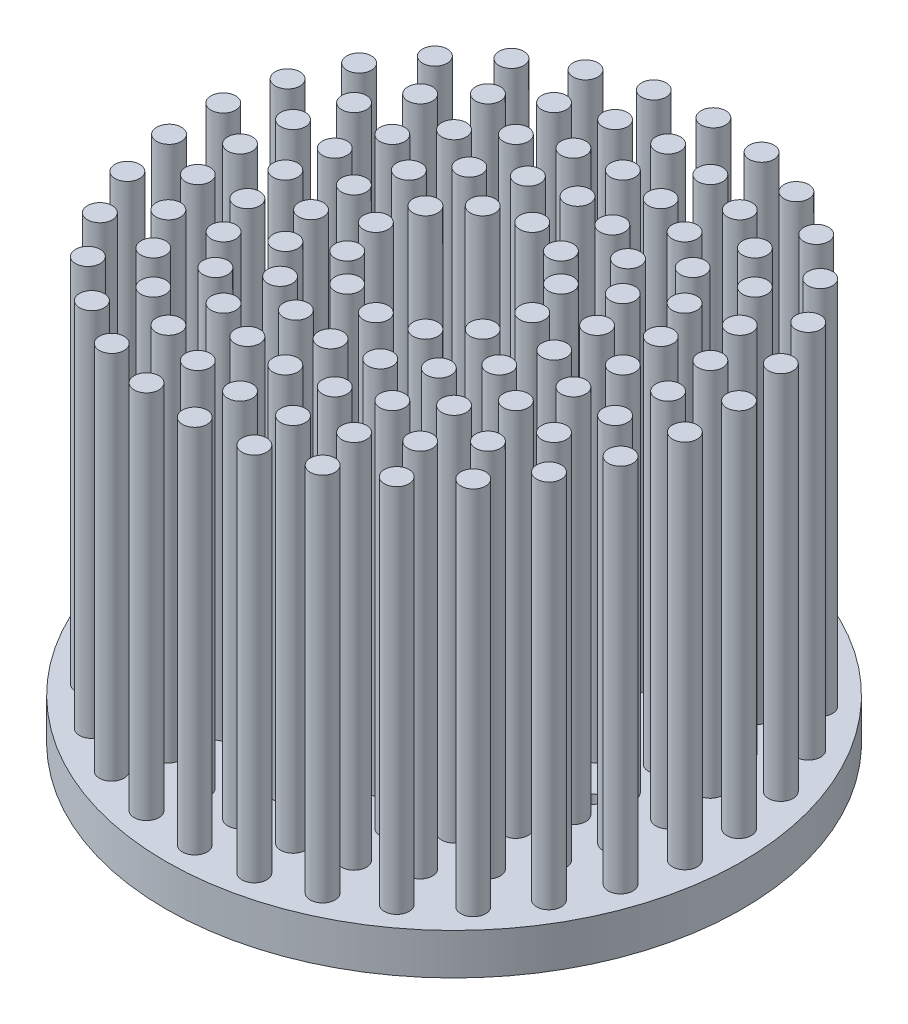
from build123d import *

# Parameters (mm, degrees)
SKETCH_1_R                = 35
EXTRUDE_1_DEPTH           = 3
SKETCH_2_R                = 1.5
EXTRUDE_2_DEPTH           = 27
SKETCH_6_R                = 1.5
EXTRUDE_4_DEPTH           = 27
PATTERN_CIRCULAR_3_COUNT  = 6
SKETCH_7_R                = 1.5
EXTRUDE_5_DEPTH           = 27
PATTERN_CIRCULAR_4_COUNT  = 12
SKETCH_8_R                = 1.5
EXTRUDE_6_DEPTH           = 27
PATTERN_CIRCULAR_5_COUNT  = 18
SKETCH_10_R               = 1.5
EXTRUDE_7_DEPTH           = 27
PATTERN_CIRCULAR_6_COUNT  = 24
SKETCH_11_R               = 1.5
EXTRUDE_8_DEPTH           = 27
PATTERN_CIRCULAR_7_COUNT  = 28
SKETCH_13_R               = 7
CUT_EXTRUDE_3_DEPTH       = 27
SKETCH_15_R               = 1.5
EXTRUDE_10_DEPTH          = 27
PATTERN_CIRCULAR_8_COUNT  = 5
SKETCH_23_R               = 1.5
EXTRUDE_16_DEPTH          = 27
PATTERN_CIRCULAR_9_COUNT  = 30
SKETCH_26_R               = 1.5
EXTRUDE_18_DEPTH          = 37
SKETCH_27_R               = 35
EXTRUDE_19_DEPTH          = 2
M2X0_4_TAPPED_HOLE1_D     = 1.6
M2X0_4_TAPPED_HOLE1_DEPTH = 6
M2X0_4_TAPPED_HOLE1_TIP   = 0.480688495
SKETCH5_R                 = 5.75
EXTRUDE2_DEPTH            = 64.639610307
SKETCH6_R                 = 42.190571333
EXTRUDE3_DEPTH            = 10
SKETCH7_R                 = 1.5
EXTRUDE4_DEPTH            = 20


with BuildPart() as part:
    # Sketch 1 → Extrude 1 (new body)
    with BuildSketch(Plane(origin=(0, 0, 0), x_dir=(1, 0, 0), z_dir=(0, 1, 0))):
        with Locations(Location((0, 0, 0), (0, 0, 270))):
            Circle(SKETCH_1_R)
    extrude(amount=EXTRUDE_1_DEPTH)

    # Sketch 2 → Extrude 2 (add)
    with BuildSketch(Plane(origin=(0, 3, 0), x_dir=(1, 0, 0), z_dir=(0, 1, 0))):
        with Locations(Location((0, 0, 0), (0, 0, 270))):
            Circle(SKETCH_2_R)
    extrude(amount=EXTRUDE_2_DEPTH)

    # Sketch 6 → Extrude 4 (add)
    with BuildSketch(Plane(origin=(0, 3, 0), x_dir=(1, 0, 0), z_dir=(0, 1, 0))):
        with Locations(Location((0, 5.5, 0), (0, 0, 270))):
            Circle(SKETCH_6_R)
    extrude_4 = extrude(amount=EXTRUDE_4_DEPTH)

    # Pattern Circular 3: Extrude 4 ×6 about axis
    pattern_circular_3_axis = Axis((0, 0, 0), (0, 1, 0))
    for i in range(1, PATTERN_CIRCULAR_3_COUNT):
        add(extrude_4.rotate(pattern_circular_3_axis, i * 360 / PATTERN_CIRCULAR_3_COUNT))

    # Sketch 7 → Extrude 5 (add)
    with BuildSketch(Plane(origin=(0, 3, 0), x_dir=(1, 0, 0), z_dir=(0, 1, 0))):
        with Locations(Location((0, 9.5, 0), (0, 0, 270))):
            Circle(SKETCH_7_R)
    extrude_5 = extrude(amount=EXTRUDE_5_DEPTH)

    # Pattern Circular 4: Extrude 5 ×12 about axis
    pattern_circular_4_axis = Axis((0, 0, 0), (0, 1, 0))
    for i in range(1, PATTERN_CIRCULAR_4_COUNT):
        add(extrude_5.rotate(pattern_circular_4_axis, i * 360 / PATTERN_CIRCULAR_4_COUNT))

    # Sketch 8 → Extrude 6 (add)
    with BuildSketch(Plane(origin=(0, 3, 0), x_dir=(1, 0, 0), z_dir=(0, 1, 0))):
        with Locations(Location((0, 15, 0), (0, 0, 270))):
            Circle(SKETCH_8_R)
    extrude_6 = extrude(amount=EXTRUDE_6_DEPTH)

    # Pattern Circular 5: Extrude 6 ×18 about axis
    pattern_circular_5_axis = Axis((0, 0, 0), (0, 1, 0))
    for i in range(1, PATTERN_CIRCULAR_5_COUNT):
        add(extrude_6.rotate(pattern_circular_5_axis, i * 360 / PATTERN_CIRCULAR_5_COUNT))

    # Sketch 10 → Extrude 7 (add)
    with BuildSketch(Plane(origin=(0, 3, 0), x_dir=(1, 0, 0), z_dir=(0, 1, 0))):
        with Locations(Location((0, 20.5, 0), (0, 0, 270))):
            Circle(SKETCH_10_R)
    extrude_7 = extrude(amount=EXTRUDE_7_DEPTH)

    # Pattern Circular 6: Extrude 7 ×24 about axis
    pattern_circular_6_axis = Axis((0, 0, 0), (0, 1, 0))
    for i in range(1, PATTERN_CIRCULAR_6_COUNT):
        add(extrude_7.rotate(pattern_circular_6_axis, i * 360 / PATTERN_CIRCULAR_6_COUNT))

    # Sketch 11 → Extrude 8 (add)
    with BuildSketch(Plane(origin=(0, 3, 0), x_dir=(1, 0, 0), z_dir=(0, 1, 0))):
        with Locations(Location((0, 26, 0), (0, 0, 270))):
            Circle(SKETCH_11_R)
    extrude_8 = extrude(amount=EXTRUDE_8_DEPTH)

    # Pattern Circular 7: Extrude 8 ×28 about axis
    pattern_circular_7_axis = Axis((0, 0, 0), (0, 1, 0))
    for i in range(1, PATTERN_CIRCULAR_7_COUNT):
        add(extrude_8.rotate(pattern_circular_7_axis, i * 360 / PATTERN_CIRCULAR_7_COUNT))

    # Sketch 13 → Cut-Extrude 3 (cut)
    with BuildSketch(Plane(origin=(0, 3, 0), x_dir=(1, 0, 0), z_dir=(0, 1, 0))):
        Circle(SKETCH_13_R)
    extrude(amount=CUT_EXTRUDE_3_DEPTH, mode=Mode.SUBTRACT)

    # Sketch 15 → Extrude 10 (add)
    with BuildSketch(Plane(origin=(0, 3, 0), x_dir=(1, 0, 0), z_dir=(0, 1, 0))):
        with Locations(Location((0, 4, 0), (0, 0, 270))):
            Circle(SKETCH_15_R)
    extrude_10 = extrude(amount=EXTRUDE_10_DEPTH)

    # Pattern Circular 8: Extrude 10 ×5 about axis
    pattern_circular_8_axis = Axis((0, 0, 0), (0, 1, 0))
    for i in range(1, PATTERN_CIRCULAR_8_COUNT):
        add(extrude_10.rotate(pattern_circular_8_axis, i * 360 / PATTERN_CIRCULAR_8_COUNT))

    # Sketch 23 → Extrude 16 (add)
    with BuildSketch(Plane(origin=(0, 3, 0), x_dir=(1, 0, 0), z_dir=(0, 1, 0))):
        with Locations(Location((0, 31.5, 0), (0, 0, 270))):
            Circle(SKETCH_23_R)
    extrude_16 = extrude(amount=EXTRUDE_16_DEPTH)

    # Pattern Circular 9: Extrude 16 ×30 about axis
    pattern_circular_9_axis = Axis((0, 0, 0), (0, 1, 0))
    for i in range(1, PATTERN_CIRCULAR_9_COUNT):
        add(extrude_16.rotate(pattern_circular_9_axis, i * 360 / PATTERN_CIRCULAR_9_COUNT))

    # Sketch 26 → Extrude 18 (add)
    with BuildSketch(Plane(origin=(0, 3, 0), x_dir=(1, 0, 0), z_dir=(0, 1, 0))):
        with Locations(Location((-17.753520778, -10.25, 0), (0, 0, 30))):
            Circle(SKETCH_26_R)
        with Locations(Location((-14.772116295, -2.604722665, 0), (0, 0, 10))):
            Circle(SKETCH_26_R)
        with Locations(Location((-19.801479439, -5.305790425, 0), (0, 0, 15))):
            Circle(SKETCH_26_R)
        with Locations(Location((-19.801479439, 5.305790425, 0), (0, 0, 345))):
            Circle(SKETCH_26_R)
        with Locations(Location((-17.753520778, 10.25, 0), (0, 0, 330))):
            Circle(SKETCH_26_R)
        with Locations(Location((-12.990381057, 7.5, 0), (0, 0, 330))):
            Circle(SKETCH_26_R)
        with Locations(Location((-9.641814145, 11.490666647, 0), (0, 0, 310))):
            Circle(SKETCH_26_R)
        with Locations(Location((-14.495689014, 14.495689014, 0), (0, 0, 315))):
            Circle(SKETCH_26_R)
        with Locations(Location((-10.25, 17.753520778, 0), (0, 0, 300))):
            Circle(SKETCH_26_R)
        with Locations(Location((-4.75, 8.227241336, 0), (0, 0, 300))):
            Circle(SKETCH_26_R)
        with Locations(Location((9.641814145, 11.490666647, 0), (0, 0, 230))):
            Circle(SKETCH_26_R)
        with Locations(Location((12.990381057, 7.5, 0), (0, 0, 210))):
            Circle(SKETCH_26_R)
        with Locations(Location((14.772116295, 2.604722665, 0), (0, 0, 190))):
            Circle(SKETCH_26_R)
        with Locations(Location((8.227241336, 4.75, 0), (0, 0, 210))):
            Circle(SKETCH_26_R)
        with Locations(Location((3.804226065, 1.236067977, 0), (0, 0, 198))):
            Circle(SKETCH_26_R)
        with Locations(Location((19.801479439, -5.305790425, 0), (0, 0, 165))):
            Circle(SKETCH_26_R)
        with Locations(Location((0, 26, 0), (0, 0, 270))):
            Circle(SKETCH_26_R)
        with Locations(Location((-6.549218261, 30.811649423, 0), (0, 0, 282))):
            Circle(SKETCH_26_R)
        with Locations(Location((-5.305790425, -19.801479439, 0), (0, 0, 75))):
            Circle(SKETCH_26_R)
        with Locations(Location((12.990381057, -7.5, 0), (0, 0, 150))):
            Circle(SKETCH_26_R)
        with Locations(Location((9.641814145, -11.490666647, 0), (0, 0, 130))):
            Circle(SKETCH_26_R)
        with Locations(Location((5.13030215, -14.095389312, 0), (0, 0, 110))):
            Circle(SKETCH_26_R)
        with Locations(Location((0, -9.5, 0), (0, 0, 90))):
            Circle(SKETCH_26_R)
        with Locations(Location((8.227241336, -4.75, 0), (0, 0, 150))):
            Circle(SKETCH_26_R)
        with Locations(Location((2.351141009, -3.236067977, 0), (0, 0, 126))):
            Circle(SKETCH_26_R)
        with Locations(Location((0, 4, 0), (0, 0, 270))):
            Circle(SKETCH_26_R)
        with Locations(Location((-8.227241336, 4.75, 0), (0, 0, 330))):
            Circle(SKETCH_26_R)
        with Locations((-9.5, 0)):
            Circle(SKETCH_26_R)
        with Locations(Location((-8.227241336, -4.75, 0), (0, 0, 30))):
            Circle(SKETCH_26_R)
        with Locations(Location((-4.75, -8.227241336, 0), (0, 0, 60))):
            Circle(SKETCH_26_R)
        with Locations(Location((-5.13030215, -14.095389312, 0), (0, 0, 70))):
            Circle(SKETCH_26_R)
        with Locations(Location((-10.25, -17.753520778, 0), (0, 0, 60))):
            Circle(SKETCH_26_R)
        with Locations(Location((-23.425190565, -11.280977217, 0), (0, 0, 25.714285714))):
            Circle(SKETCH_26_R)
        with Locations(Location((-29.958280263, -9.734035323, 0), (0, 0, 18))):
            Circle(SKETCH_26_R)
        with Locations((-26, 0)):
            Circle(SKETCH_26_R)
        with Locations(Location((-23.425190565, 11.280977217, 0), (0, 0, 334.285714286))):
            Circle(SKETCH_26_R)
        with Locations(Location((-18.515235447, 25.484035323, 0), (0, 0, 306))):
            Circle(SKETCH_26_R)
        with Locations(Location((-12.812204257, 28.776681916, 0), (0, 0, 294))):
            Circle(SKETCH_26_R)
        with Locations(Location((5.13030215, 14.095389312, 0), (0, 0, 250))):
            Circle(SKETCH_26_R)
        with Locations(Location((5.305790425, 19.801479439, 0), (0, 0, 255))):
            Circle(SKETCH_26_R)
        with Locations(Location((10.25, 17.753520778, 0), (0, 0, 240))):
            Circle(SKETCH_26_R)
        with Locations(Location((14.495689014, 14.495689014, 0), (0, 0, 225))):
            Circle(SKETCH_26_R)
        with Locations(Location((19.801479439, 5.305790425, 0), (0, 0, 195))):
            Circle(SKETCH_26_R)
        with Locations(Location((29.958280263, 9.734035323, 0), (0, 0, 198))):
            Circle(SKETCH_26_R)
        with Locations(Location((23.425190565, 11.280977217, 0), (0, 0, 205.714285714))):
            Circle(SKETCH_26_R)
        with Locations(Location((20.327618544, 16.210734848, 0), (0, 0, 218.571428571))):
            Circle(SKETCH_26_R)
        with Locations(Location((16.210734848, 20.327618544, 0), (0, 0, 231.428571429))):
            Circle(SKETCH_26_R)
        with Locations(Location((5.785544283, 25.348125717, 0), (0, 0, 257.142857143))):
            Circle(SKETCH_26_R)
        with Locations(Location((0, 9.5, 0), (0, 0, 270))):
            Circle(SKETCH_26_R)
        with Locations(Location((4.75, 8.227241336, 0), (0, 0, 240))):
            Circle(SKETCH_26_R)
        with Locations(Location((9.5, 0, 0), (0, 0, 180))):
            Circle(SKETCH_26_R)
        with Locations(Location((14.772116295, -2.604722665, 0), (0, 0, 170))):
            Circle(SKETCH_26_R)
        with Locations(Location((20.5, 0, 0), (0, 0, 180))):
            Circle(SKETCH_26_R)
        with Locations(Location((25.348125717, -5.785544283, 0), (0, 0, 167.142857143))):
            Circle(SKETCH_26_R)
        with Locations(Location((23.425190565, -11.280977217, 0), (0, 0, 154.285714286))):
            Circle(SKETCH_26_R)
        with Locations(Location((12.812204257, -28.776681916, 0), (0, 0, 114))):
            Circle(SKETCH_26_R)
        with Locations(Location((6.549218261, -30.811649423, 0), (0, 0, 102))):
            Circle(SKETCH_26_R)
        with Locations(Location((5.785544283, -25.348125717, 0), (0, 0, 102.857142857))):
            Circle(SKETCH_26_R)
        with Locations(Location((0, -31.5, 0), (0, 0, 90))):
            Circle(SKETCH_26_R)
        with Locations(Location((-6.549218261, -30.811649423, 0), (0, 0, 78))):
            Circle(SKETCH_26_R)
        with Locations(Location((-12.812204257, -28.776681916, 0), (0, 0, 66))):
            Circle(SKETCH_26_R)
        with Locations(Location((-18.515235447, -25.484035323, 0), (0, 0, 54))):
            Circle(SKETCH_26_R)
        with Locations(Location((-16.210734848, -20.327618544, 0), (0, 0, 51.428571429))):
            Circle(SKETCH_26_R)
        with Locations(Location((-23.409062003, -21.0776141, 0), (0, 0, 42))):
            Circle(SKETCH_26_R)
        with Locations(Location((0, -20.5, 0), (0, 0, 90))):
            Circle(SKETCH_26_R)
        with Locations(Location((5.305790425, -19.801479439, 0), (0, 0, 105))):
            Circle(SKETCH_26_R)
        with Locations(Location((10.25, -17.753520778, 0), (0, 0, 120))):
            Circle(SKETCH_26_R)
        with Locations(Location((14.495689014, -14.495689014, 0), (0, 0, 135))):
            Circle(SKETCH_26_R)
        with Locations(Location((17.753520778, -10.25, 0), (0, 0, 150))):
            Circle(SKETCH_26_R)
        with Locations(Location((0, -15, 0), (0, 0, 90))):
            Circle(SKETCH_26_R)
        with Locations(Location((4.75, -8.227241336, 0), (0, 0, 120))):
            Circle(SKETCH_26_R)
        with Locations(Location((-2.351141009, -3.236067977, 0), (0, 0, 54))):
            Circle(SKETCH_26_R)
        with Locations(Location((-3.804226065, 1.236067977, 0), (0, 0, 342))):
            Circle(SKETCH_26_R)
        with Locations(Location((-14.495689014, -14.495689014, 0), (0, 0, 45))):
            Circle(SKETCH_26_R)
        with Locations(Location((-9.641814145, -11.490666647, 0), (0, 0, 50))):
            Circle(SKETCH_26_R)
        with Locations(Location((-12.990381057, -7.5, 0), (0, 0, 30))):
            Circle(SKETCH_26_R)
        with Locations((-20.5, 0)):
            Circle(SKETCH_26_R)
        with Locations(Location((-14.772116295, 2.604722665, 0), (0, 0, 350))):
            Circle(SKETCH_26_R)
        with Locations(Location((-5.13030215, 14.095389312, 0), (0, 0, 290))):
            Circle(SKETCH_26_R)
        with Locations(Location((23.409062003, 21.0776141, 0), (0, 0, 222))):
            Circle(SKETCH_26_R)
        with Locations(Location((18.515235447, 25.484035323, 0), (0, 0, 234))):
            Circle(SKETCH_26_R)
        with Locations(Location((11.280977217, 23.425190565, 0), (0, 0, 244.285714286))):
            Circle(SKETCH_26_R)
        with Locations(Location((12.812204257, 28.776681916, 0), (0, 0, 246))):
            Circle(SKETCH_26_R)
        with Locations(Location((6.549218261, 30.811649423, 0), (0, 0, 258))):
            Circle(SKETCH_26_R)
        with Locations(Location((0, 31.5, 0), (0, 0, 270))):
            Circle(SKETCH_26_R)
        with Locations(Location((-31.327439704, -3.292646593, 0), (0, 0, 6))):
            Circle(SKETCH_26_R)
        with Locations(Location((-31.327439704, 3.292646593, 0), (0, 0, 354))):
            Circle(SKETCH_26_R)
        with Locations(Location((-29.958280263, 9.734035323, 0), (0, 0, 342))):
            Circle(SKETCH_26_R)
        with Locations(Location((-25.348125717, 5.785544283, 0), (0, 0, 347.142857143))):
            Circle(SKETCH_26_R)
        with Locations(Location((-27.279800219, 15.75, 0), (0, 0, 330))):
            Circle(SKETCH_26_R)
        with Locations(Location((-20.327618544, 16.210734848, 0), (0, 0, 321.428571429))):
            Circle(SKETCH_26_R)
        with Locations(Location((-23.409062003, 21.0776141, 0), (0, 0, 318))):
            Circle(SKETCH_26_R)
        with Locations(Location((-16.210734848, 20.327618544, 0), (0, 0, 308.571428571))):
            Circle(SKETCH_26_R)
        with Locations(Location((-11.280977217, 23.425190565, 0), (0, 0, 295.714285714))):
            Circle(SKETCH_26_R)
        with Locations(Location((-5.785544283, 25.348125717, 0), (0, 0, 282.857142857))):
            Circle(SKETCH_26_R)
        with Locations(Location((-5.305790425, 19.801479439, 0), (0, 0, 285))):
            Circle(SKETCH_26_R)
        with Locations(Location((0, 20.5, 0), (0, 0, 270))):
            Circle(SKETCH_26_R)
        with Locations(Location((0, 15, 0), (0, 0, 270))):
            Circle(SKETCH_26_R)
        with Locations(Location((17.753520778, 10.25, 0), (0, 0, 210))):
            Circle(SKETCH_26_R)
        with Locations(Location((25.348125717, 5.785544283, 0), (0, 0, 192.857142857))):
            Circle(SKETCH_26_R)
        with Locations(Location((27.279800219, 15.75, 0), (0, 0, 210))):
            Circle(SKETCH_26_R)
        with Locations(Location((26, 0, 0), (0, 0, 180))):
            Circle(SKETCH_26_R)
        with Locations(Location((31.327439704, -3.292646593, 0), (0, 0, 174))):
            Circle(SKETCH_26_R)
        with Locations(Location((31.327439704, 3.292646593, 0), (0, 0, 186))):
            Circle(SKETCH_26_R)
        with Locations(Location((29.958280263, -9.734035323, 0), (0, 0, 162))):
            Circle(SKETCH_26_R)
        with Locations(Location((27.279800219, -15.75, 0), (0, 0, 150))):
            Circle(SKETCH_26_R)
        with Locations(Location((20.327618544, -16.210734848, 0), (0, 0, 141.428571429))):
            Circle(SKETCH_26_R)
        with Locations(Location((23.409062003, -21.0776141, 0), (0, 0, 138))):
            Circle(SKETCH_26_R)
        with Locations(Location((16.210734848, -20.327618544, 0), (0, 0, 128.571428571))):
            Circle(SKETCH_26_R)
        with Locations(Location((18.515235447, -25.484035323, 0), (0, 0, 126))):
            Circle(SKETCH_26_R)
        with Locations(Location((11.280977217, -23.425190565, 0), (0, 0, 115.714285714))):
            Circle(SKETCH_26_R)
        with Locations(Location((0, -26, 0), (0, 0, 90))):
            Circle(SKETCH_26_R)
        with Locations(Location((-5.785544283, -25.348125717, 0), (0, 0, 77.142857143))):
            Circle(SKETCH_26_R)
        with Locations(Location((-11.280977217, -23.425190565, 0), (0, 0, 64.285714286))):
            Circle(SKETCH_26_R)
        with Locations(Location((-20.327618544, -16.210734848, 0), (0, 0, 38.571428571))):
            Circle(SKETCH_26_R)
        with Locations(Location((-27.279800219, -15.75, 0), (0, 0, 30))):
            Circle(SKETCH_26_R)
        with Locations(Location((-25.348125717, -5.785544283, 0), (0, 0, 12.857142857))):
            Circle(SKETCH_26_R)
    extrude(amount=EXTRUDE_18_DEPTH)

    # Sketch 27 → Extrude 19 (add)
    with BuildSketch(Plane(origin=(0, 3, 0), x_dir=(1, 0, 0), z_dir=(0, 1, 0))):
        with Locations(Location((0, 0, 0), (0, 0, 270))):
            Circle(SKETCH_27_R)
    extrude(amount=EXTRUDE_19_DEPTH)

    # M2x0.4 Tapped Hole1
    with Locations(Plane.XZ):
        with Locations((-11.870847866, 15.470390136), (19.333174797, 2.545260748), (-7.462326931, -18.015650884)):
            Hole(M2X0_4_TAPPED_HOLE1_D / 2, depth=M2X0_4_TAPPED_HOLE1_DEPTH)
            with Locations((0, 0, -(M2X0_4_TAPPED_HOLE1_DEPTH + M2X0_4_TAPPED_HOLE1_TIP / 2))):  # 118° drill point
                Cone(0, M2X0_4_TAPPED_HOLE1_D / 2, M2X0_4_TAPPED_HOLE1_TIP, mode=Mode.SUBTRACT)

    # Sketch5 → Extrude2 (cut, through all)
    with BuildSketch(Plane.XZ):
        with Locations(Location((0, 0, 0), (0, 0, 270))):
            Circle(SKETCH5_R)
    extrude(amount=-EXTRUDE2_DEPTH, mode=Mode.SUBTRACT)

    # Sketch6 → Extrude3 (cut)
    with BuildSketch(Plane(origin=(0, 40, 0), x_dir=(1, 0, 0), z_dir=(0, 1, 0))):
        Circle(SKETCH6_R)
    extrude(amount=-EXTRUDE3_DEPTH, mode=Mode.SUBTRACT)

    # Sketch7 → Extrude4 (add)
    with BuildSketch(Plane(origin=(0, 30, 0), x_dir=(1, 0, 0), z_dir=(0, 1, 0))):
        with Locations(Location((8.227241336, 4.75, 0), (0, 0, 270))):
            Circle(SKETCH7_R)
        with Locations(Location((4.75, 8.227241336, 0), (0, 0, 270))):
            Circle(SKETCH7_R)
        with Locations(Location((-4.75, 8.227241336, 0), (0, 0, 270))):
            Circle(SKETCH7_R)
        with Locations(Location((-8.227241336, 4.75, 0), (0, 0, 270))):
            Circle(SKETCH7_R)
        with Locations(Location((-9.5, 0, 0), (0, 0, 270))):
            Circle(SKETCH7_R)
        with Locations(Location((-8.227241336, -4.75, 0), (0, 0, 270))):
            Circle(SKETCH7_R)
        with Locations(Location((-4.75, -8.227241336, 0), (0, 0, 270))):
            Circle(SKETCH7_R)
        with Locations(Location((0, -9.5, 0), (0, 0, 270))):
            Circle(SKETCH7_R)
        with Locations(Location((4.75, -8.227241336, 0), (0, 0, 270))):
            Circle(SKETCH7_R)
        with Locations(Location((8.227241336, -4.75, 0), (0, 0, 270))):
            Circle(SKETCH7_R)
        with Locations(Location((9.5, 0, 0), (0, 0, 270))):
            Circle(SKETCH7_R)
        with Locations(Location((14.772116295, 2.604722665, 0), (0, 0, 270))):
            Circle(SKETCH7_R)
        with Locations(Location((14.772116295, -2.604722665, 0), (0, 0, 270))):
            Circle(SKETCH7_R)
        with Locations(Location((12.990381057, -7.5, 0), (0, 0, 270))):
            Circle(SKETCH7_R)
        with Locations(Location((9.641814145, -11.490666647, 0), (0, 0, 270))):
            Circle(SKETCH7_R)
        with Locations(Location((0, -15, 0), (0, 0, 270))):
            Circle(SKETCH7_R)
        with Locations(Location((-5.13030215, -14.095389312, 0), (0, 0, 270))):
            Circle(SKETCH7_R)
        with Locations(Location((-9.641814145, -11.490666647, 0), (0, 0, 270))):
            Circle(SKETCH7_R)
        with Locations(Location((-12.990381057, -7.5, 0), (0, 0, 270))):
            Circle(SKETCH7_R)
        with Locations(Location((-14.772116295, -2.604722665, 0), (0, 0, 270))):
            Circle(SKETCH7_R)
        with Locations(Location((-14.772116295, 2.604722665, 0), (0, 0, 270))):
            Circle(SKETCH7_R)
        with Locations(Location((-12.990381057, 7.5, 0), (0, 0, 270))):
            Circle(SKETCH7_R)
        with Locations(Location((-9.641814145, 11.490666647, 0), (0, 0, 270))):
            Circle(SKETCH7_R)
        with Locations(Location((9.641814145, 11.490666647, 0), (0, 0, 270))):
            Circle(SKETCH7_R)
        with Locations(Location((17.753520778, 10.25, 0), (0, 0, 270))):
            Circle(SKETCH7_R)
        with Locations(Location((23.425190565, 11.280977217, 0), (0, 0, 270))):
            Circle(SKETCH7_R)
        with Locations(Location((27.279800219, 15.75, 0), (0, 0, 270))):
            Circle(SKETCH7_R)
        with Locations(Location((10.25, 17.753520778, 0), (0, 0, 270))):
            Circle(SKETCH7_R)
        with Locations(Location((14.495689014, 14.495689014, 0), (0, 0, 270))):
            Circle(SKETCH7_R)
        with Locations(Location((20.327618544, 16.210734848, 0), (0, 0, 270))):
            Circle(SKETCH7_R)
        with Locations(Location((23.409062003, 21.0776141, 0), (0, 0, 270))):
            Circle(SKETCH7_R)
        with Locations(Location((12.812204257, 28.776681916, 0), (0, 0, 270))):
            Circle(SKETCH7_R)
        with Locations(Location((6.549218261, 30.811649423, 0), (0, 0, 270))):
            Circle(SKETCH7_R)
        with Locations(Location((5.305790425, 19.801479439, 0), (0, 0, 270))):
            Circle(SKETCH7_R)
        with Locations(Location((0, 20.5, 0), (0, 0, 270))):
            Circle(SKETCH7_R)
        with Locations(Location((0, 31.5, 0), (0, 0, 270))):
            Circle(SKETCH7_R)
        with Locations(Location((-6.549218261, 30.811649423, 0), (0, 0, 270))):
            Circle(SKETCH7_R)
        with Locations(Location((-5.305790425, 19.801479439, 0), (0, 0, 270))):
            Circle(SKETCH7_R)
        with Locations(Location((-10.25, 17.753520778, 0), (0, 0, 270))):
            Circle(SKETCH7_R)
        with Locations(Location((-11.280977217, 23.425190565, 0), (0, 0, 270))):
            Circle(SKETCH7_R)
        with Locations(Location((-12.812204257, 28.776681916, 0), (0, 0, 270))):
            Circle(SKETCH7_R)
        with Locations(Location((-18.515235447, 25.484035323, 0), (0, 0, 270))):
            Circle(SKETCH7_R)
        with Locations(Location((-16.210734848, 20.327618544, 0), (0, 0, 270))):
            Circle(SKETCH7_R)
        with Locations(Location((-14.495689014, 14.495689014, 0), (0, 0, 270))):
            Circle(SKETCH7_R)
        with Locations(Location((-20.327618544, 16.210734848, 0), (0, 0, 270))):
            Circle(SKETCH7_R)
        with Locations(Location((-23.409062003, 21.0776141, 0), (0, 0, 270))):
            Circle(SKETCH7_R)
        with Locations(Location((-27.279800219, 15.75, 0), (0, 0, 270))):
            Circle(SKETCH7_R)
        with Locations(Location((-23.425190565, 11.280977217, 0), (0, 0, 270))):
            Circle(SKETCH7_R)
        with Locations(Location((-17.753520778, 10.25, 0), (0, 0, 270))):
            Circle(SKETCH7_R)
        with Locations(Location((-19.801479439, 5.305790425, 0), (0, 0, 270))):
            Circle(SKETCH7_R)
        with Locations(Location((-25.348125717, 5.785544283, 0), (0, 0, 270))):
            Circle(SKETCH7_R)
        with Locations(Location((-20.5, 0, 0), (0, 0, 270))):
            Circle(SKETCH7_R)
        with Locations(Location((-29.958280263, 9.734035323, 0), (0, 0, 270))):
            Circle(SKETCH7_R)
        with Locations(Location((-31.327439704, 3.292646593, 0), (0, 0, 270))):
            Circle(SKETCH7_R)
        with Locations(Location((-31.327439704, -3.292646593, 0), (0, 0, 270))):
            Circle(SKETCH7_R)
        with Locations(Location((-29.958280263, -9.734035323, 0), (0, 0, 270))):
            Circle(SKETCH7_R)
        with Locations(Location((-17.753520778, -10.25, 0), (0, 0, 270))):
            Circle(SKETCH7_R)
        with Locations(Location((-20.327618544, -16.210734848, 0), (0, 0, 270))):
            Circle(SKETCH7_R)
        with Locations(Location((-14.495689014, -14.495689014, 0), (0, 0, 270))):
            Circle(SKETCH7_R)
        with Locations(Location((-16.210734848, -20.327618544, 0), (0, 0, 270))):
            Circle(SKETCH7_R)
        with Locations(Location((-23.409062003, -21.0776141, 0), (0, 0, 270))):
            Circle(SKETCH7_R)
        with Locations(Location((-18.515235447, -25.484035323, 0), (0, 0, 270))):
            Circle(SKETCH7_R)
        with Locations(Location((-11.280977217, -23.425190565, 0), (0, 0, 270))):
            Circle(SKETCH7_R)
        with Locations(Location((-10.25, -17.753520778, 0), (0, 0, 270))):
            Circle(SKETCH7_R)
        with Locations(Location((-5.305790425, -19.801479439, 0), (0, 0, 270))):
            Circle(SKETCH7_R)
        with Locations(Location((5.305790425, -19.801479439, 0), (0, 0, 270))):
            Circle(SKETCH7_R)
        with Locations(Location((14.495689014, -14.495689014, 0), (0, 0, 270))):
            Circle(SKETCH7_R)
        with Locations(Location((19.801479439, 5.305790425, 0), (0, 0, 270))):
            Circle(SKETCH7_R)
        with Locations(Location((25.348125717, 5.785544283, 0), (0, 0, 270))):
            Circle(SKETCH7_R)
        with Locations(Location((29.958280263, 9.734035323, 0), (0, 0, 270))):
            Circle(SKETCH7_R)
        with Locations(Location((31.327439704, 3.292646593, 0), (0, 0, 270))):
            Circle(SKETCH7_R)
        with Locations(Location((31.327439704, -3.292646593, 0), (0, 0, 270))):
            Circle(SKETCH7_R)
        with Locations(Location((29.958280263, -9.734035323, 0), (0, 0, 270))):
            Circle(SKETCH7_R)
        with Locations(Location((23.409062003, -21.0776141, 0), (0, 0, 270))):
            Circle(SKETCH7_R)
        with Locations(Location((20.327618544, -16.210734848, 0), (0, 0, 270))):
            Circle(SKETCH7_R)
        with Locations(Location((23.425190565, -11.280977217, 0), (0, 0, 270))):
            Circle(SKETCH7_R)
        with Locations(Location((17.753520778, -10.25, 0), (0, 0, 270))):
            Circle(SKETCH7_R)
        with Locations(Location((19.801479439, -5.305790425, 0), (0, 0, 270))):
            Circle(SKETCH7_R)
        with Locations(Location((20.5, 0, 0), (0, 0, 270))):
            Circle(SKETCH7_R)
        with Locations(Location((26, 0, 0), (0, 0, 270))):
            Circle(SKETCH7_R)
        with Locations(Location((25.348125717, -5.785544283, 0), (0, 0, 270))):
            Circle(SKETCH7_R)
        with Locations(Location((-12.812204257, -28.776681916, 0), (0, 0, 270))):
            Circle(SKETCH7_R)
        with Locations(Location((-5.785544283, -25.348125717, 0), (0, 0, 270))):
            Circle(SKETCH7_R)
        with Locations(Location((-6.549218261, -30.811649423, 0), (0, 0, 270))):
            Circle(SKETCH7_R)
        with Locations(Location((0, -31.5, 0), (0, 0, 270))):
            Circle(SKETCH7_R)
        with Locations(Location((0, -26, 0), (0, 0, 270))):
            Circle(SKETCH7_R)
        with Locations(Location((5.785544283, -25.348125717, 0), (0, 0, 270))):
            Circle(SKETCH7_R)
        with Locations(Location((6.549218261, -30.811649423, 0), (0, 0, 270))):
            Circle(SKETCH7_R)
        with Locations(Location((11.280977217, -23.425190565, 0), (0, 0, 270))):
            Circle(SKETCH7_R)
        with Locations(Location((16.210734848, -20.327618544, 0), (0, 0, 270))):
            Circle(SKETCH7_R)
        with Locations(Location((18.515235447, -25.484035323, 0), (0, 0, 270))):
            Circle(SKETCH7_R)
        with Locations(Location((0, 9.5, 0), (0, 0, 270))):
            Circle(SKETCH7_R)
        with Locations(Location((5.13030215, -14.095389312, 0), (0, 0, 270))):
            Circle(SKETCH7_R)
        with Locations(Location((-5.13030215, 14.095389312, 0), (0, 0, 270))):
            Circle(SKETCH7_R)
        with Locations(Location((0, 15, 0), (0, 0, 270))):
            Circle(SKETCH7_R)
        with Locations(Location((5.13030215, 14.095389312, 0), (0, 0, 270))):
            Circle(SKETCH7_R)
        with Locations(Location((12.990381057, 7.5, 0), (0, 0, 270))):
            Circle(SKETCH7_R)
        with Locations(Location((16.210734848, 20.327618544, 0), (0, 0, 270))):
            Circle(SKETCH7_R)
        with Locations(Location((18.515235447, 25.484035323, 0), (0, 0, 270))):
            Circle(SKETCH7_R)
        with Locations(Location((11.280977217, 23.425190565, 0), (0, 0, 270))):
            Circle(SKETCH7_R)
        with Locations(Location((5.785544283, 25.348125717, 0), (0, 0, 270))):
            Circle(SKETCH7_R)
        with Locations(Location((0, 26, 0), (0, 0, 270))):
            Circle(SKETCH7_R)
        with Locations(Location((-5.785544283, 25.348125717, 0), (0, 0, 270))):
            Circle(SKETCH7_R)
        with Locations(Location((-26, 0, 0), (0, 0, 270))):
            Circle(SKETCH7_R)
        with Locations(Location((-25.348125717, -5.785544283, 0), (0, 0, 270))):
            Circle(SKETCH7_R)
        with Locations(Location((-19.801479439, -5.305790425, 0), (0, 0, 270))):
            Circle(SKETCH7_R)
        with Locations(Location((-23.425190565, -11.280977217, 0), (0, 0, 270))):
            Circle(SKETCH7_R)
        with Locations(Location((-27.279800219, -15.75, 0), (0, 0, 270))):
            Circle(SKETCH7_R)
        with Locations(Location((0, -20.5, 0), (0, 0, 270))):
            Circle(SKETCH7_R)
        with Locations(Location((10.25, -17.753520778, 0), (0, 0, 270))):
            Circle(SKETCH7_R)
        with Locations(Location((27.279800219, -15.75, 0), (0, 0, 270))):
            Circle(SKETCH7_R)
        with Locations(Location((12.812204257, -28.776681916, 0), (0, 0, 270))):
            Circle(SKETCH7_R)
    extrude(amount=EXTRUDE4_DEPTH)


solid = part.part
